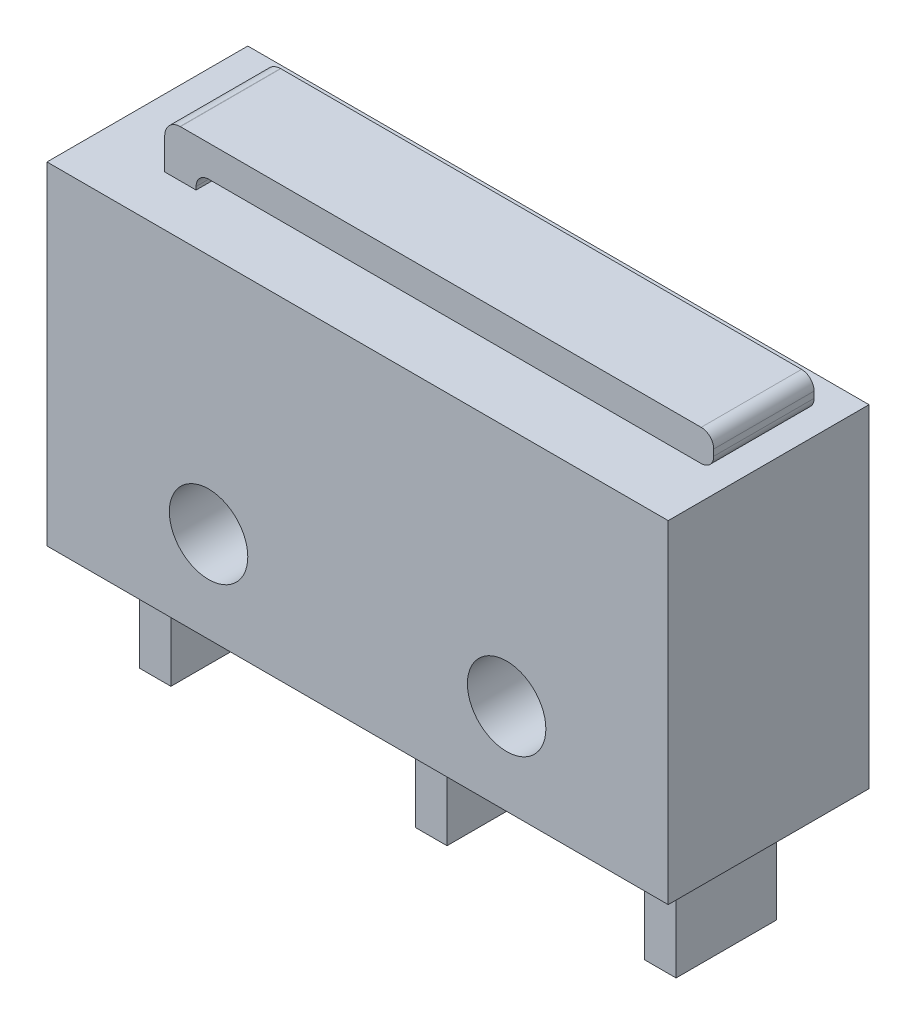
from build123d import *

# Parameters (mm, degrees)
ESQUISSE1_W             = 19.8
ESQUISSE1_H             = 6.4
BOSS_EXTRU_1_DEPTH      = 10.6
ESQUISSE2_W             = 1
ESQUISSE2_H             = 3.5
BOSS_EXTRU_2_DEPTH      = 1.6
ESQUISSE3_R             = 1.25
ENL_V_MAT_EXTRU_1_DEPTH = 5
BOSS_EXTRU_3_DEPTH      = 1.6


with BuildPart() as part:
    # Esquisse1 → Boss.-Extru.1 (new body)
    with BuildSketch(Plane(origin=(0, 0, 0), x_dir=(1, 0, 0), z_dir=(0, 1, 0))):
        Rectangle(ESQUISSE1_W, ESQUISSE1_H)
    extrude(amount=BOSS_EXTRU_1_DEPTH)

    # Esquisse2 → Boss.-Extru.2 (add, symmetric)
    with BuildSketch(Plane.XY):
        with Locations((-8.05, -1.75)):
            Rectangle(ESQUISSE2_W, ESQUISSE2_H)
        with Locations((0.75, -1.75)):
            Rectangle(ESQUISSE2_W, ESQUISSE2_H)
        with Locations((8.05, -1.75)):
            Rectangle(ESQUISSE2_W, ESQUISSE2_H)
    extrude(amount=BOSS_EXTRU_2_DEPTH, both=True)

    # Esquisse3 → Enl_v. mat.-Extru.1 (cut, symmetric)
    with BuildSketch(Plane.XY):
        with Locations((-4.75, 2.9)):
            Circle(ESQUISSE3_R)
        with Locations((4.75, 2.9)):
            Circle(ESQUISSE3_R)
    extrude(amount=ENL_V_MAT_EXTRU_1_DEPTH, both=True, mode=Mode.SUBTRACT)

    # Esquisse4 → Boss.-Extru.3 (add, symmetric)
    with BuildSketch(Plane.XY):
        with BuildLine():
            Line((-6.747282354, 10.6), (-6.747282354, 10.7))
            ThreePointArc((-6.747282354, 10.7), (-6.630125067, 10.982842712), (-6.347282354, 11.1))
            Line((-6.347282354, 11.1), (9.35, 11.1))
            ThreePointArc((9.35, 11.1), (9.632842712, 11.217157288), (9.75, 11.5))
            Line((9.75, 11.5), (9.75, 11.7))
            ThreePointArc((9.75, 11.7), (9.632842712, 11.982842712), (9.35, 12.1))
            Line((9.35, 12.1), (-7.247282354, 12.1))
            Line((-7.247282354, 12.1), (-7.258911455, 12.099729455))
            ThreePointArc((-7.258911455, 12.099729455), (-7.60492362, 11.949282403), (-7.747282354, 11.599864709))
            Line((-7.747282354, 11.599864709), (-7.747282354, 10.6))
            Line((-7.747282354, 10.6), (-6.747282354, 10.6))
        make_face()
    extrude(amount=BOSS_EXTRU_3_DEPTH, both=True)


solid = part.part
